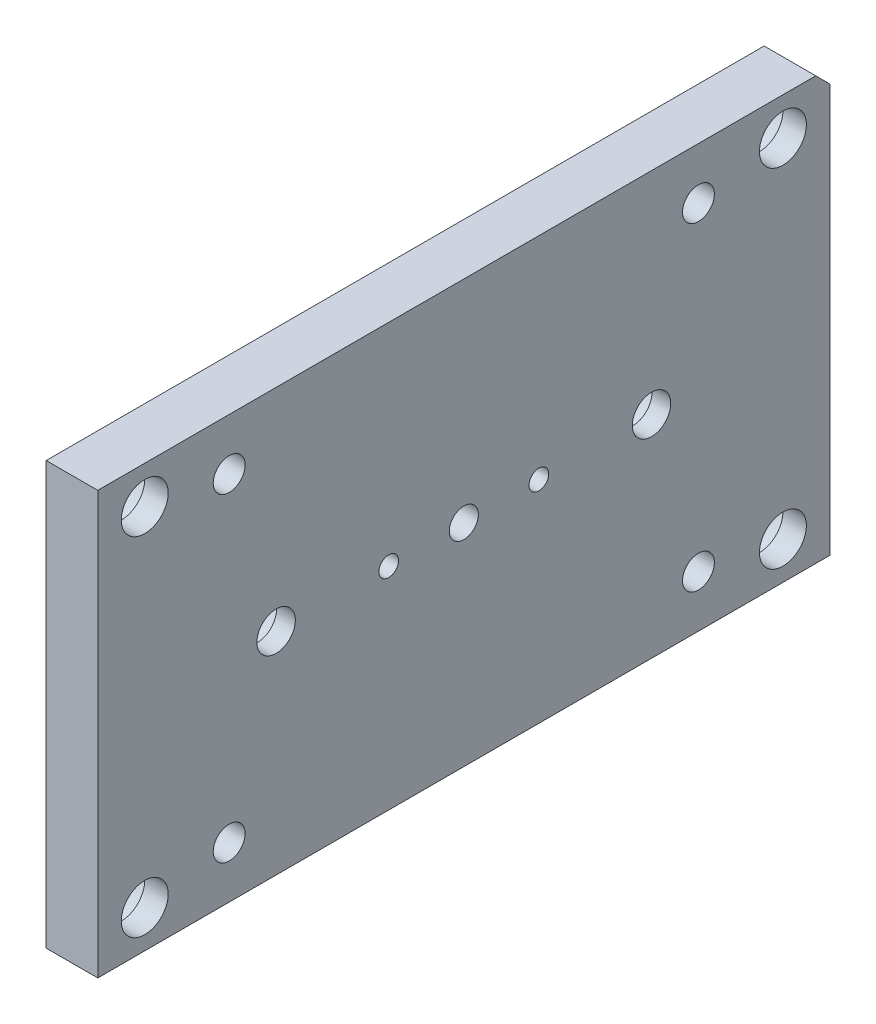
from build123d import *

# Parameters (mm, degrees)
ESQUISSE1_W             = 156
ESQUISSE1_H             = 90
EXTRUSION1_DEPTH        = 11
ESQUISSE32_R            = 4.1
ESQUISSE32_R_2          = 5
ESQUISSE32_R_3          = 3.1
ESQUISSE32_R_4          = 2.1
ENL_V_MAT_EXTRU_1_DEPTH = 133.540790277
TROU_TARAUD_M81_D       = 6.8
ESQUISSE35_R            = 7.5
ENL_V_MAT_EXTRU_2_DEPTH = 6
ESQUISSE37_R            = 4.25
ENL_V_MAT_EXTRU_4_DEPTH = 4
ESQUISSE38_R            = 7.5
ENL_V_MAT_EXTRU_5_DEPTH = 7
CHANFREIN_D_SIZE        = 3


with BuildPart() as part:
    # Esquisse1 → Extrusion1 (new body)
    with BuildSketch(Plane(origin=(0, 0, 0), x_dir=(0, 0, -1), z_dir=(1, 0, 0))):
        Rectangle(ESQUISSE1_W, ESQUISSE1_H)
    extrude(amount=EXTRUSION1_DEPTH)

    # Esquisse32 → Enl_v. mat.-Extru.1 (cut, through all)
    with BuildSketch(Plane(origin=(0, 29.694794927, -30.93460744), x_dir=(0, 0, 1), z_dir=(-1, 0, 0))):
        with Locations((-9.06539256, -29.694794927)):
            Circle(ESQUISSE32_R)
        with Locations((-37.06539256, 7.305205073)):
            Circle(ESQUISSE32_R_2)
        with Locations((70.93460744, -29.694794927)):
            Circle(ESQUISSE32_R)
        with Locations((98.93460744, 7.305205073)):
            Circle(ESQUISSE32_R_2)
        with Locations((98.93460744, -66.694794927)):
            Circle(ESQUISSE32_R_2)
        with Locations((-37.06539256, -66.694794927)):
            Circle(ESQUISSE32_R_2)
        with Locations((30.93460744, -29.694794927)):
            Circle(ESQUISSE32_R_3)
        with Locations((14.93460744, -29.694794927)):
            Circle(ESQUISSE32_R_4)
        with Locations((46.93460744, -29.694794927)):
            Circle(ESQUISSE32_R_4)
    extrude(amount=-ENL_V_MAT_EXTRU_1_DEPTH, mode=Mode.SUBTRACT)

    # Trou taraud_ M81 (through all)
    with Locations(Plane.ZY):
        with Locations((50, 34), (-50, 34), (-50, -34), (50, -34)):
            Hole(TROU_TARAUD_M81_D / 2)

    # Esquisse35 → Enl_v. mat.-Extru.2 (cut)
    with BuildSketch(Plane.ZY):
        with Locations((-68, 37)):
            Circle(ESQUISSE35_R)
        with Locations((68, 37)):
            Circle(ESQUISSE35_R)
        with Locations((68, -37)):
            Circle(ESQUISSE35_R)
        with Locations((-68, -37)):
            Circle(ESQUISSE35_R)
    extrude(amount=-ENL_V_MAT_EXTRU_2_DEPTH, mode=Mode.SUBTRACT)

    # Esquisse37 → Enl_v. mat.-Extru.4 (cut)
    with BuildSketch(Plane.ZY):
        with Locations((-16, 0)):
            Circle(ESQUISSE37_R)
        with Locations((16, 0)):
            Circle(ESQUISSE37_R)
    extrude(amount=-ENL_V_MAT_EXTRU_4_DEPTH, mode=Mode.SUBTRACT)

    # Esquisse38 → Enl_v. mat.-Extru.5 (cut)
    with BuildSketch(Plane.ZY):
        with Locations((-40, 0)):
            Circle(ESQUISSE38_R)
        with Locations((40, 0)):
            Circle(ESQUISSE38_R)
    extrude(amount=-ENL_V_MAT_EXTRU_5_DEPTH, mode=Mode.SUBTRACT)

    # Chanfrein_D
    chanfrein_d_edges = [part.edges().sort_by_distance(p)[0] for p in [
        (5.5, 45, -78),
    ]]
    chamfer(chanfrein_d_edges, length=CHANFREIN_D_SIZE)


solid = part.part
